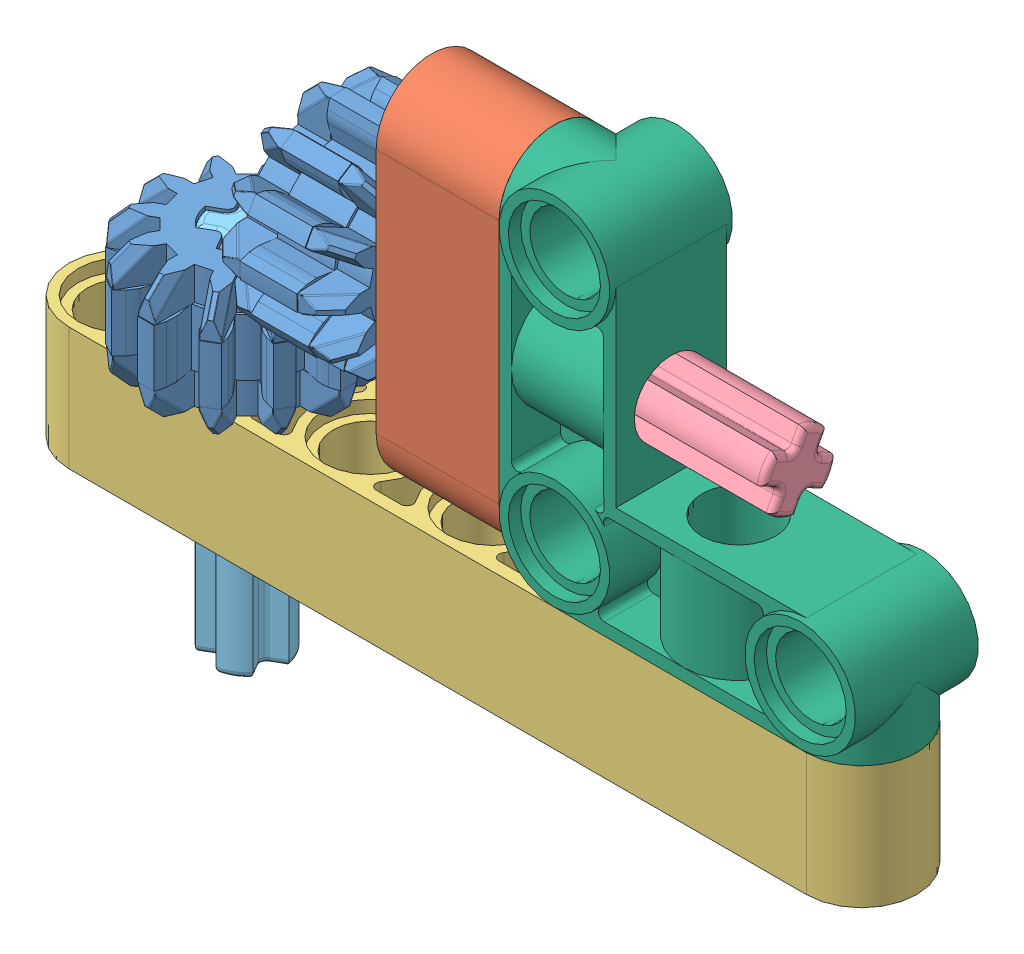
SolidWorks assembly 30.3.SLDASM, configuration Default (file format 12000). Lengths in mm.
Overall size (55.2 39.6 18.13).
7 component instances, 6 part files, 17 mates.
Components (placement in the parent):
- 32270 Gear 12 Tooth Double Bevel-1: 32270 Gear 12 Tooth Double Bevel.SLDPRT [Default] at (-25.4587 12.1583 23.08) x (0 0.468884 0.88326) z (0 -0.88326 0.468884) size (13.27 8.11 13.27)
- 32270 Gear 12 Tooth Double Bevel-2: 32270 Gear 12 Tooth Double Bevel.SLDPRT [Default] at (-33.4587 4.1583 23.08) x (-0.501409 0 -0.86521) z (0.86521 0 -0.501409) size (13.27 8.11 13.27)
- 32523 Beam 3 Orange-1: 32523 Beam 3 Orange.SLDPRT [Default] at (-13.4587 4.1583 23.08) x (0 1 0) z (0 0 1) size (23.2 8 7.2)
- 32524 Beam 7 Blue-1: 32524 Beam 7 Blue.SLDPRT [Default] at (-41.4587 -7.8417 23.08) size (55.2 8 7.2)
- 3705 Axle 4 Black-1: 3705 Axle 4 Black.SLDPRT [Default] at (2.5413 12.1583 23.08) x (0 -0.468884 -0.88326) z (0 0.88326 -0.468884) size (4.8 32 4.8)
- 4519 Axle 3-1: 4519 Axle 3.SLDPRT [Default] at (-33.4587 -15.8417 23.08) x (0.501409 0 0.86521) z (-0.86521 0 0.501409) size (4.8 24 4.8)
- 55615 Pin Connector Perpendicular 3 x 3 Bent with 4 Pins-1: 55615 Pin Connector Perpendicular 3 x 3 Bent with 4 Pins.SLDPRT [Default] at (-9.4587 4.1583 23.08) x (-1 0 0) z (0 -1 0) size (31.6 8 31.6)
Mates (geometry in assembly coordinates):
- Concentric1: concentric anti-aligned: cylinder of 32270 Gear 12 Tooth Double Bevel-2 through (-33.4587 0.1007 23.08) axis (0 1 0) radius 2.4; cylinder of 4519 Axle 3-1 through (-33.4587 8.1583 23.08) axis (0 -1 0) radius 2.4
- Coincident1: coincident anti-aligned: plane of 32270 Gear 12 Tooth Double Bevel-2 through (-34.8618 0.1007 22.4138) normal (0.86521 0 -0.501409); plane of 4519 Axle 3-1 through (-33.1005 8.1583 25.4532) normal (-0.86521 0 0.501409)
- Coincident2: coincident aligned: plane of 32270 Gear 12 Tooth Double Bevel-2 through (-33.4587 8.1583 23.08) normal (0 1 0); plane of 4519 Axle 3-1 through (-33.4587 8.1583 23.08) normal (0 1 0)
- Concentric2: concentric aligned: cylinder of 32524 Beam 7 Blue-1 through (-33.4587 0.1583 23.08) axis (0 -1 0) radius 2.4; cylinder of 4519 Axle 3-1 through (-33.4587 8.1583 23.08) axis (0 -1 0) radius 2.4
- Concentric3: concentric anti-aligned: cylinder of 32524 Beam 7 Blue-1 through (-9.4587 0.1583 23.08) axis (0 -1 0) radius 2.4; cylinder of 55615 Pin Connector Perpendicular 3 x 3 Bent with 4 Pins-1 through (-9.4587 -7.8417 23.08) axis (0 1 0) radius 2.4
- Concentric4: concentric anti-aligned: cylinder of 32524 Beam 7 Blue-1 through (6.5413 0.1583 23.08) axis (0 -1 0) radius 2.4; cylinder of 55615 Pin Connector Perpendicular 3 x 3 Bent with 4 Pins-1 through (6.5413 -7.8417 23.08) axis (0 1 0) radius 2.4
- Coincident3: coincident anti-aligned: plane of 32524 Beam 7 Blue-1 through (-9.4587 -0.6417 23.08) normal (0 1 0); plane of 55615 Pin Connector Perpendicular 3 x 3 Bent with 4 Pins-1 through (-9.4587 -0.6417 23.08) normal (0 -1 0)
- Concentric6: concentric aligned: cylinder of 32523 Beam 3 Orange-1 through (-21.4587 20.1583 23.08) axis (1 0 0) radius 2.4; cylinder of 55615 Pin Connector Perpendicular 3 x 3 Bent with 4 Pins-1 through (-21.4587 20.1583 23.08) axis (1 0 0) radius 2.4
- Concentric7: concentric aligned: cylinder of 32523 Beam 3 Orange-1 through (-21.4587 4.1583 23.08) axis (1 0 0) radius 2.4; cylinder of 55615 Pin Connector Perpendicular 3 x 3 Bent with 4 Pins-1 through (-21.4587 4.1583 23.08) axis (1 0 0) radius 2.4
- Coincident4: coincident anti-aligned: plane of 32523 Beam 3 Orange-1 through (-14.2587 20.1583 23.08) normal (1 0 0); plane of 55615 Pin Connector Perpendicular 3 x 3 Bent with 4 Pins-1 through (-14.2587 20.1583 23.08) normal (-1 0 0)
- Concentric8: concentric anti-aligned: cylinder of 32270 Gear 12 Tooth Double Bevel-1 through (-21.4011 12.1583 23.08) axis (-1 0 0) radius 2.4; cylinder of 3705 Axle 4 Black-1 through (-29.4587 12.1583 23.08) axis (1 0 0) radius 2.4
- Coincident5: coincident anti-aligned: plane of 32270 Gear 12 Tooth Double Bevel-1 through (-21.4011 10.6151 22.9029) normal (0 0.468884 0.88326); plane of 3705 Axle 4 Black-1 through (-29.4587 13.7178 21.2558) normal (0 -0.468884 -0.88326)
- Coincident6: coincident aligned: plane of 32270 Gear 12 Tooth Double Bevel-1 through (-29.4587 12.1583 23.08) normal (-1 0 0); plane of 3705 Axle 4 Black-1 through (-29.4587 12.1583 23.08) normal (-1 0 0)
- Concentric9: concentric aligned: cylinder of 32523 Beam 3 Orange-1 through (-21.4587 12.1583 23.08) axis (1 0 0) radius 2.4; cylinder of 3705 Axle 4 Black-1 through (-29.4587 12.1583 23.08) axis (1 0 0) radius 2.4
- Coincident7: coincident anti-aligned: plane of 32270 Gear 12 Tooth Double Bevel-1 through (-21.4587 12.1583 23.08) normal (1 0 0); plane of 32523 Beam 3 Orange-1 through (-21.4587 4.1583 23.08) normal (-1 0 0)
- Coincident8: coincident anti-aligned: plane of 32270 Gear 12 Tooth Double Bevel-2 through (-33.4587 0.1583 23.08) normal (0 -1 0); plane of 32524 Beam 7 Blue-1 through (-41.4587 0.1583 23.08) normal (0 1 0)
- GearMate1: gear = 8.065 mm: circle of 32270 Gear 12 Tooth Double Bevel-2; circle of 32270 Gear 12 Tooth Double Bevel-1
